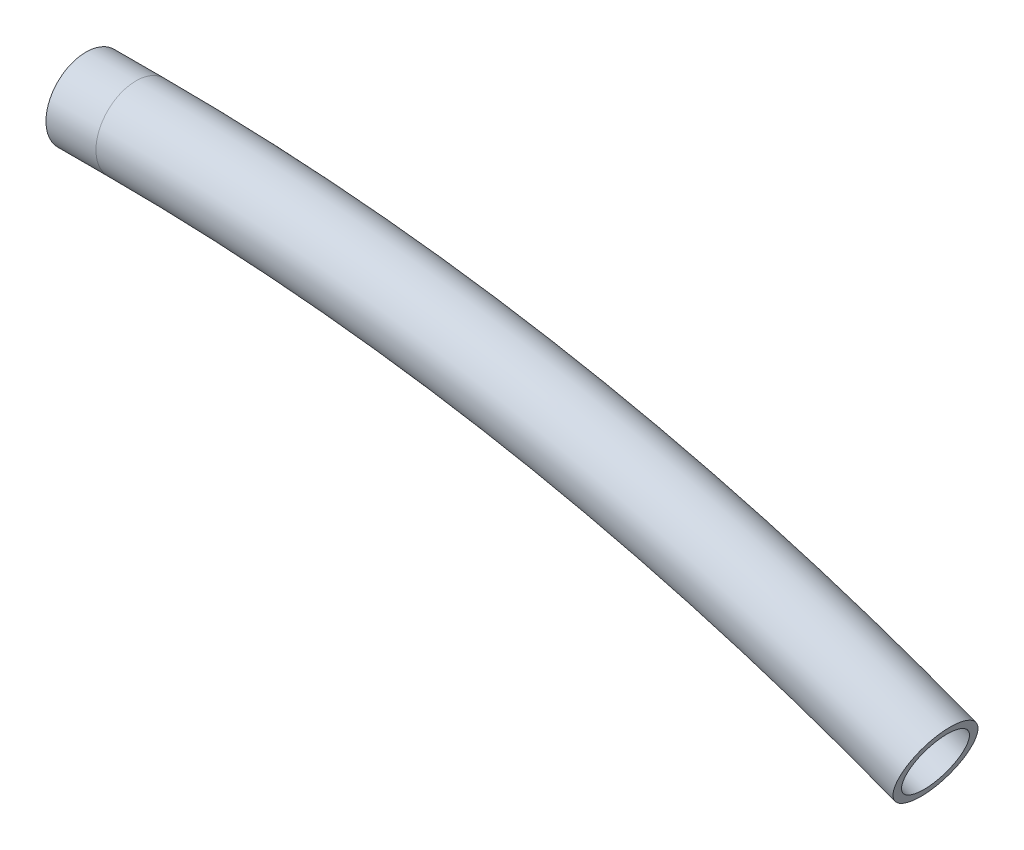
from build123d import *

# Parameters (mm, degrees)
ESQUISSE2_R   = 8
ESQUISSE2_R_2 = 6.4


with BuildPart() as part:
    # Balayage1: sweep along a path in Esquisse1
    with BuildLine(Plane.XY) as balayage1_path:
        Line((0, 0), (10, 0))
        ThreePointArc((10, 0), (91.39410298, -7.564784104), (170, -30))
    # Esquisse2 → Balayage1 (sweep)
    with BuildSketch(Plane(origin=(0, 0, 0), x_dir=(0, 0, -1), z_dir=(1, 0, 0))):
        Circle(ESQUISSE2_R)
        Circle(ESQUISSE2_R_2, mode=Mode.SUBTRACT)
    sweep(path=balayage1_path.line)


solid = part.part
